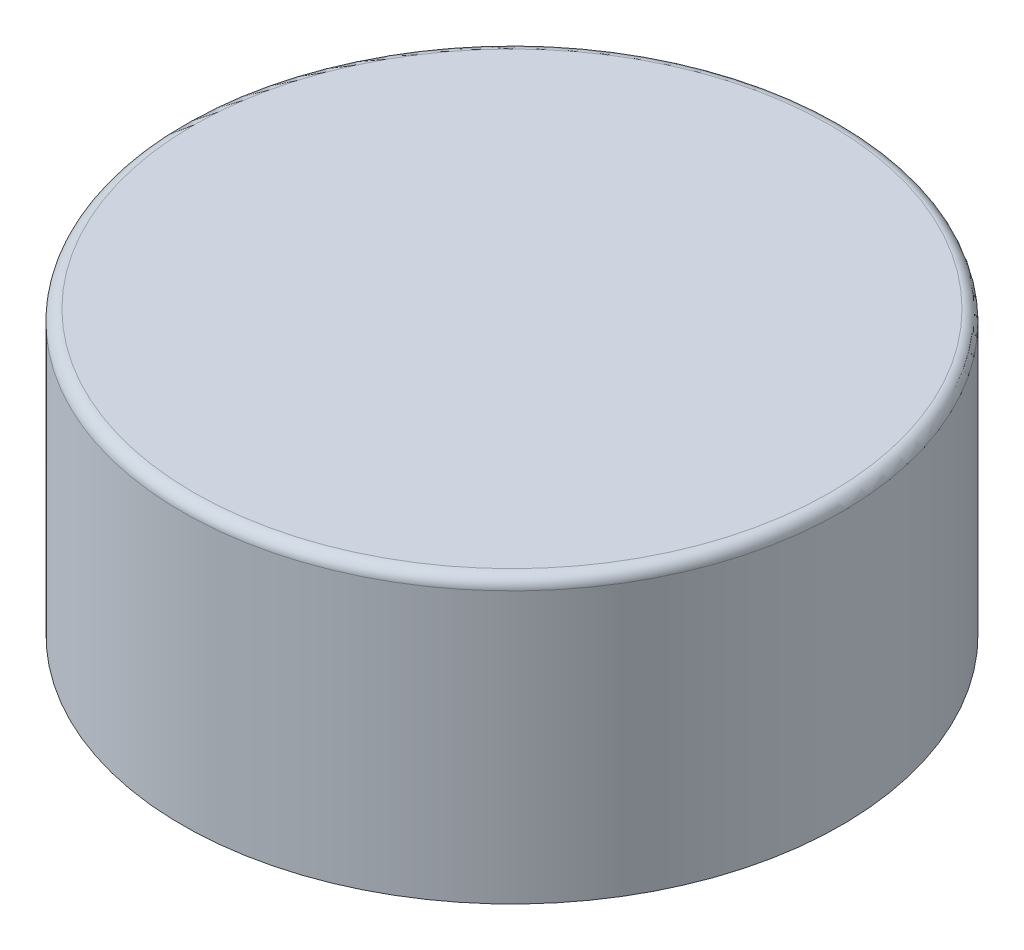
ISO-10303-21;
HEADER;
FILE_DESCRIPTION(('STEP AP214'),'2;1');
FILE_NAME('part.step','',(''),(''),'','','');
FILE_SCHEMA(('AUTOMOTIVE_DESIGN { 1 0 10303 214 1 1 1 1 }'));
ENDSEC;
DATA;
#1=APPLICATION_CONTEXT('core data for automotive mechanical design processes');
#2=APPLICATION_PROTOCOL_DEFINITION('international standard','automotive_design',2000,#1);
#3=PRODUCT_CONTEXT('',#1,'mechanical');
#4=PRODUCT('Part','Part','',(#3));
#5=PRODUCT_RELATED_PRODUCT_CATEGORY('part','',(#4));
#6=PRODUCT_DEFINITION_FORMATION('','',#4);
#7=PRODUCT_DEFINITION_CONTEXT('part definition',#1,'design');
#8=PRODUCT_DEFINITION('design','',#6,#7);
#9=PRODUCT_DEFINITION_SHAPE('','',#8);
#10=(LENGTH_UNIT() NAMED_UNIT(*) SI_UNIT(.MILLI.,.METRE.));
#11=(NAMED_UNIT(*) PLANE_ANGLE_UNIT() SI_UNIT($,.RADIAN.));
#12=(NAMED_UNIT(*) SI_UNIT($,.STERADIAN.) SOLID_ANGLE_UNIT());
#13=UNCERTAINTY_MEASURE_WITH_UNIT(LENGTH_MEASURE(1.E-05),#10,'distance_accuracy_value','');
#14=(GEOMETRIC_REPRESENTATION_CONTEXT(3) GLOBAL_UNCERTAINTY_ASSIGNED_CONTEXT((#13)) GLOBAL_UNIT_ASSIGNED_CONTEXT((#10,
#11,#12)) REPRESENTATION_CONTEXT('',''));
#15=CARTESIAN_POINT('',(0.,0.,0.));
#16=DIRECTION('',(0.,0.,1.));
#17=DIRECTION('',(1.,0.,0.));
#18=AXIS2_PLACEMENT_3D('',#15,#16,#17);
#19=CARTESIAN_POINT('',(6.25,3.625,21.03));
#20=DIRECTION('',(0.,1.,0.));
#21=DIRECTION('',(0.,0.,1.));
#22=AXIS2_PLACEMENT_3D('',#19,#20,#21);
#23=PLANE('',#22);
#24=CARTESIAN_POINT('',(6.25,3.625,21.03));
#25=DIRECTION('',(0.,-1.,0.));
#26=DIRECTION('',(0.,0.,-1.));
#27=AXIS2_PLACEMENT_3D('',#24,#25,#26);
#28=CIRCLE('',#27,0.845000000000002);
#29=CARTESIAN_POINT('',(7.095,3.625,21.03));
#30=VERTEX_POINT('',#29);
#31=CARTESIAN_POINT('',(6.25,3.625,20.185));
#32=VERTEX_POINT('',#31);
#33=EDGE_CURVE('E36',#30,#32,#28,.F.);
#34=ORIENTED_EDGE('',*,*,#33,.T.);
#35=CARTESIAN_POINT('',(6.25,3.625,21.03));
#36=DIRECTION('',(0.,-1.,0.));
#37=DIRECTION('',(0.,0.,1.));
#38=AXIS2_PLACEMENT_3D('',#35,#36,#37);
#39=CIRCLE('',#38,0.845000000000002);
#40=CARTESIAN_POINT('',(6.25,3.625,21.875));
#41=VERTEX_POINT('',#40);
#42=EDGE_CURVE('E43',#41,#32,#39,.T.);
#43=ORIENTED_EDGE('',*,*,#42,.F.);
#44=CARTESIAN_POINT('',(6.25,3.625,21.03));
#45=DIRECTION('',(0.,-1.,0.));
#46=DIRECTION('',(1.,0.,0.));
#47=AXIS2_PLACEMENT_3D('',#44,#45,#46);
#48=CIRCLE('',#47,0.844999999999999);
#49=EDGE_CURVE('E41',#41,#30,#48,.F.);
#50=ORIENTED_EDGE('',*,*,#49,.T.);
#51=EDGE_LOOP('',(#34,#43,#50));
#52=FACE_BOUND('',#51,.T.);
#53=ADVANCED_FACE('F17',(#52),#23,.T.);
#54=CARTESIAN_POINT('',(6.25,3.595,21.03));
#55=DIRECTION('',(0.,1.,0.));
#56=DIRECTION('',(0.,0.,1.));
#57=AXIS2_PLACEMENT_3D('',#54,#55,#56);
#58=TOROIDAL_SURFACE('',#57,0.844999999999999,0.03);
#59=CARTESIAN_POINT('',(6.25,3.595,21.03));
#60=DIRECTION('',(0.,-1.,0.));
#61=DIRECTION('',(0.,0.,-1.));
#62=AXIS2_PLACEMENT_3D('',#59,#60,#61);
#63=CIRCLE('',#62,0.875);
#64=CARTESIAN_POINT('',(6.25,3.595,20.155));
#65=VERTEX_POINT('',#64);
#66=EDGE_CURVE('E28',#65,#65,#63,.T.);
#67=ORIENTED_EDGE('',*,*,#66,.F.);
#68=EDGE_LOOP('',(#67));
#69=FACE_BOUND('',#68,.T.);
#70=ORIENTED_EDGE('',*,*,#33,.F.);
#71=ORIENTED_EDGE('',*,*,#49,.F.);
#72=ORIENTED_EDGE('',*,*,#42,.T.);
#73=EDGE_LOOP('',(#70,#71,#72));
#74=FACE_BOUND('',#73,.T.);
#75=ADVANCED_FACE('F50',(#69,#74),#58,.T.);
#76=CARTESIAN_POINT('',(6.25,3.25,21.03));
#77=DIRECTION('',(0.,-1.,0.));
#78=DIRECTION('',(0.,0.,-1.));
#79=AXIS2_PLACEMENT_3D('',#76,#77,#78);
#80=CYLINDRICAL_SURFACE('',#79,0.875);
#81=CARTESIAN_POINT('',(6.25,2.875,21.03));
#82=DIRECTION('',(0.,-1.,0.));
#83=DIRECTION('',(0.,0.,-1.));
#84=AXIS2_PLACEMENT_3D('',#81,#82,#83);
#85=CIRCLE('',#84,0.875);
#86=CARTESIAN_POINT('',(6.25,2.875,20.155));
#87=VERTEX_POINT('',#86);
#88=EDGE_CURVE('E11',#87,#87,#85,.F.);
#89=ORIENTED_EDGE('',*,*,#88,.T.);
#90=EDGE_LOOP('',(#89));
#91=FACE_BOUND('',#90,.T.);
#92=ORIENTED_EDGE('',*,*,#66,.T.);
#93=EDGE_LOOP('',(#92));
#94=FACE_BOUND('',#93,.T.);
#95=ADVANCED_FACE('F66',(#91,#94),#80,.T.);
#96=CARTESIAN_POINT('',(6.25,2.875,21.03));
#97=DIRECTION('',(0.,1.,0.));
#98=DIRECTION('',(0.,0.,1.));
#99=AXIS2_PLACEMENT_3D('',#96,#97,#98);
#100=PLANE('',#99);
#101=ORIENTED_EDGE('',*,*,#88,.F.);
#102=EDGE_LOOP('',(#101));
#103=FACE_BOUND('',#102,.T.);
#104=ADVANCED_FACE('F77',(#103),#100,.F.);
#105=CLOSED_SHELL('',(#53,#75,#95,#104));
#106=MANIFOLD_SOLID_BREP('B1',#105);
#107=ADVANCED_BREP_SHAPE_REPRESENTATION('',(#18,#106),#14);
#108=SHAPE_DEFINITION_REPRESENTATION(#9,#107);
ENDSEC;
END-ISO-10303-21;
